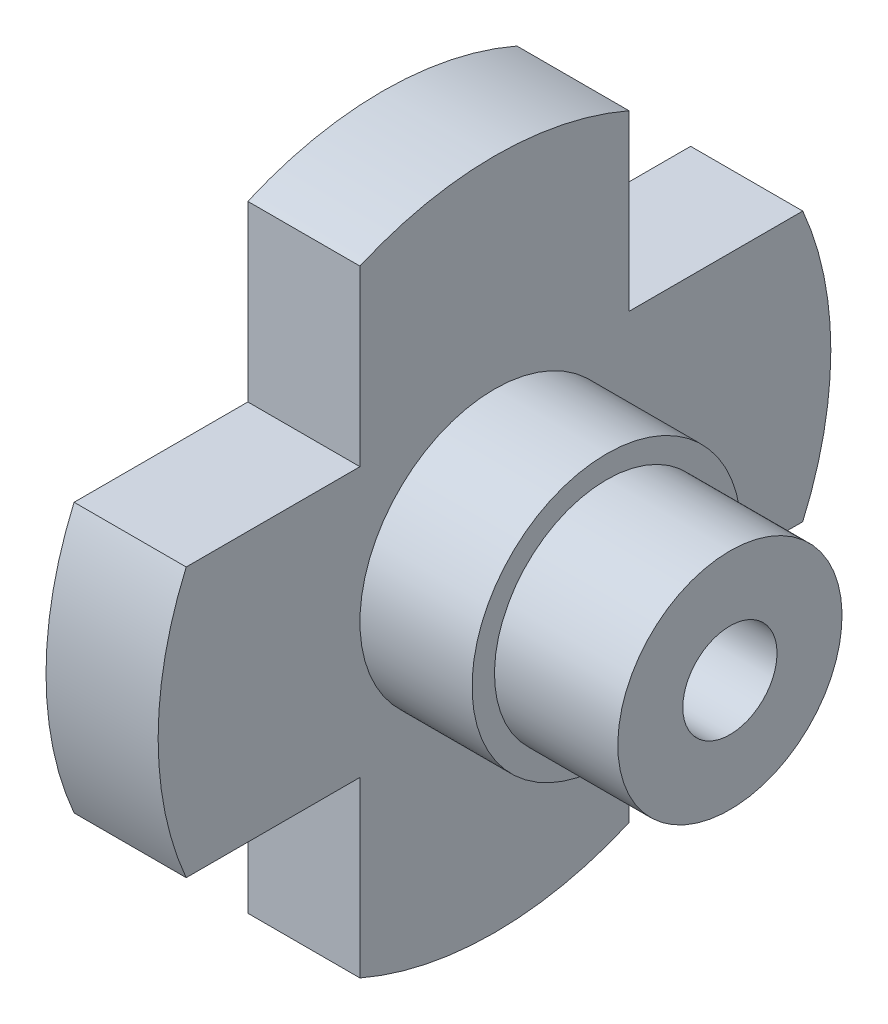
ISO-10303-21;
HEADER;
FILE_DESCRIPTION(('STEP AP214'),'2;1');
FILE_NAME('part.step','',(''),(''),'','','');
FILE_SCHEMA(('AUTOMOTIVE_DESIGN { 1 0 10303 214 1 1 1 1 }'));
ENDSEC;
DATA;
#1=APPLICATION_CONTEXT('core data for automotive mechanical design processes');
#2=APPLICATION_PROTOCOL_DEFINITION('international standard','automotive_design',2000,#1);
#3=PRODUCT_CONTEXT('',#1,'mechanical');
#4=PRODUCT('Part','Part','',(#3));
#5=PRODUCT_RELATED_PRODUCT_CATEGORY('part','',(#4));
#6=PRODUCT_DEFINITION_FORMATION('','',#4);
#7=PRODUCT_DEFINITION_CONTEXT('part definition',#1,'design');
#8=PRODUCT_DEFINITION('design','',#6,#7);
#9=PRODUCT_DEFINITION_SHAPE('','',#8);
#10=(LENGTH_UNIT() NAMED_UNIT(*) SI_UNIT(.MILLI.,.METRE.));
#11=(NAMED_UNIT(*) PLANE_ANGLE_UNIT() SI_UNIT($,.RADIAN.));
#12=(NAMED_UNIT(*) SI_UNIT($,.STERADIAN.) SOLID_ANGLE_UNIT());
#13=UNCERTAINTY_MEASURE_WITH_UNIT(LENGTH_MEASURE(1.E-05),#10,'distance_accuracy_value','');
#14=(GEOMETRIC_REPRESENTATION_CONTEXT(3) GLOBAL_UNCERTAINTY_ASSIGNED_CONTEXT((#13)) GLOBAL_UNIT_ASSIGNED_CONTEXT((#10,
#11,#12)) REPRESENTATION_CONTEXT('',''));
#15=CARTESIAN_POINT('',(0.,0.,0.));
#16=DIRECTION('',(0.,0.,1.));
#17=DIRECTION('',(1.,0.,0.));
#18=AXIS2_PLACEMENT_3D('',#15,#16,#17);
#19=CARTESIAN_POINT('',(-15.5,0.,0.));
#20=DIRECTION('',(-1.,0.,0.));
#21=DIRECTION('',(0.,-1.,0.));
#22=AXIS2_PLACEMENT_3D('',#19,#20,#21);
#23=PLANE('',#22);
#24=CARTESIAN_POINT('',(-15.5,0.,0.));
#25=DIRECTION('',(-1.,0.,0.));
#26=DIRECTION('',(0.,0.,1.));
#27=AXIS2_PLACEMENT_3D('',#24,#25,#26);
#28=CIRCLE('',#27,2.09999999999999);
#29=CARTESIAN_POINT('',(-15.5,0.,2.09999999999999));
#30=VERTEX_POINT('',#29);
#31=EDGE_CURVE('E178',#30,#30,#28,.T.);
#32=ORIENTED_EDGE('',*,*,#31,.F.);
#33=EDGE_LOOP('',(#32));
#34=FACE_BOUND('',#33,.T.);
#35=CARTESIAN_POINT('',(-15.5,0.,0.));
#36=DIRECTION('',(1.,0.,0.));
#37=DIRECTION('',(0.,1.,0.));
#38=AXIS2_PLACEMENT_3D('',#35,#36,#37);
#39=CIRCLE('',#38,15.);
#40=CARTESIAN_POINT('',(-15.5,13.7477270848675,-6.));
#41=VERTEX_POINT('',#40);
#42=CARTESIAN_POINT('',(-15.5,13.7477270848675,6.));
#43=VERTEX_POINT('',#42);
#44=EDGE_CURVE('E137',#41,#43,#39,.T.);
#45=ORIENTED_EDGE('',*,*,#44,.F.);
#46=DIRECTION('',(0.,-1.,0.));
#47=VECTOR('',#46,1.);
#48=CARTESIAN_POINT('',(-15.5,-41.5965024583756,-6.));
#49=LINE('',#48,#47);
#50=CARTESIAN_POINT('',(-15.5,6.,-6.));
#51=VERTEX_POINT('',#50);
#52=EDGE_CURVE('E124',#41,#51,#49,.T.);
#53=ORIENTED_EDGE('',*,*,#52,.T.);
#54=DIRECTION('',(0.,0.,-1.));
#55=VECTOR('',#54,1.);
#56=CARTESIAN_POINT('',(-15.5,6.,0.131629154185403));
#57=LINE('',#56,#55);
#58=CARTESIAN_POINT('',(-15.5,6.,-13.7477270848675));
#59=VERTEX_POINT('',#58);
#60=EDGE_CURVE('E129',#51,#59,#57,.T.);
#61=ORIENTED_EDGE('',*,*,#60,.T.);
#62=CARTESIAN_POINT('',(-15.5,-6.00000000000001,-13.7477270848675));
#63=VERTEX_POINT('',#62);
#64=EDGE_CURVE('E202',#63,#59,#39,.T.);
#65=ORIENTED_EDGE('',*,*,#64,.F.);
#66=DIRECTION('',(0.,0.,-1.));
#67=VECTOR('',#66,1.);
#68=CARTESIAN_POINT('',(-15.5,-6.00000000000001,0.131629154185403));
#69=LINE('',#68,#67);
#70=CARTESIAN_POINT('',(-15.5,-6.00000000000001,-6.));
#71=VERTEX_POINT('',#70);
#72=EDGE_CURVE('E169',#71,#63,#69,.T.);
#73=ORIENTED_EDGE('',*,*,#72,.F.);
#74=DIRECTION('',(0.,-1.,0.));
#75=VECTOR('',#74,1.);
#76=CARTESIAN_POINT('',(-15.5,-41.5965024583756,-6.));
#77=LINE('',#76,#75);
#78=CARTESIAN_POINT('',(-15.5,-13.7477270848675,-6.));
#79=VERTEX_POINT('',#78);
#80=EDGE_CURVE('E166',#71,#79,#77,.T.);
#81=ORIENTED_EDGE('',*,*,#80,.T.);
#82=CARTESIAN_POINT('',(-15.5,-13.7477270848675,6.));
#83=VERTEX_POINT('',#82);
#84=EDGE_CURVE('E200',#83,#79,#39,.T.);
#85=ORIENTED_EDGE('',*,*,#84,.F.);
#86=DIRECTION('',(0.,-1.,0.));
#87=VECTOR('',#86,1.);
#88=CARTESIAN_POINT('',(-15.5,-41.5965024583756,6.));
#89=LINE('',#88,#87);
#90=CARTESIAN_POINT('',(-15.5,-6.00000000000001,6.));
#91=VERTEX_POINT('',#90);
#92=EDGE_CURVE('E157',#91,#83,#89,.T.);
#93=ORIENTED_EDGE('',*,*,#92,.F.);
#94=DIRECTION('',(0.,0.,-1.));
#95=VECTOR('',#94,1.);
#96=CARTESIAN_POINT('',(-15.5,-6.00000000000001,0.131629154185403));
#97=LINE('',#96,#95);
#98=CARTESIAN_POINT('',(-15.5,-6.00000000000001,13.7477270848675));
#99=VERTEX_POINT('',#98);
#100=EDGE_CURVE('E154',#99,#91,#97,.T.);
#101=ORIENTED_EDGE('',*,*,#100,.F.);
#102=CARTESIAN_POINT('',(-15.5,6.,13.7477270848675));
#103=VERTEX_POINT('',#102);
#104=EDGE_CURVE('E241',#103,#99,#39,.T.);
#105=ORIENTED_EDGE('',*,*,#104,.F.);
#106=DIRECTION('',(0.,0.,-1.));
#107=VECTOR('',#106,1.);
#108=CARTESIAN_POINT('',(-15.5,6.,0.131629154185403));
#109=LINE('',#108,#107);
#110=CARTESIAN_POINT('',(-15.5,6.,6.));
#111=VERTEX_POINT('',#110);
#112=EDGE_CURVE('E144',#103,#111,#109,.T.);
#113=ORIENTED_EDGE('',*,*,#112,.T.);
#114=DIRECTION('',(0.,-1.,0.));
#115=VECTOR('',#114,1.);
#116=CARTESIAN_POINT('',(-15.5,-41.5965024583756,6.));
#117=LINE('',#116,#115);
#118=EDGE_CURVE('E142',#43,#111,#117,.T.);
#119=ORIENTED_EDGE('',*,*,#118,.F.);
#120=EDGE_LOOP('',(#45,#53,#61,#65,#73,#81,#85,#93,#101,#105,#113,#119));
#121=FACE_BOUND('',#120,.T.);
#122=ADVANCED_FACE('F31',(#34,#121),#23,.T.);
#123=CARTESIAN_POINT('',(-10.5,15.,0.));
#124=DIRECTION('',(1.,0.,0.));
#125=DIRECTION('',(0.,1.,0.));
#126=AXIS2_PLACEMENT_3D('',#123,#124,#125);
#127=PLANE('',#126);
#128=CARTESIAN_POINT('',(-10.5,0.,0.));
#129=DIRECTION('',(1.,0.,0.));
#130=DIRECTION('',(0.,1.,0.));
#131=AXIS2_PLACEMENT_3D('',#128,#129,#130);
#132=CIRCLE('',#131,6.);
#133=CARTESIAN_POINT('',(-10.5,5.99999999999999,0.));
#134=VERTEX_POINT('',#133);
#135=EDGE_CURVE('E193',#134,#134,#132,.T.);
#136=ORIENTED_EDGE('',*,*,#135,.F.);
#137=EDGE_LOOP('',(#136));
#138=FACE_BOUND('',#137,.T.);
#139=DIRECTION('',(0.,0.,1.));
#140=VECTOR('',#139,1.);
#141=CARTESIAN_POINT('',(-10.5,6.,0.));
#142=LINE('',#141,#140);
#143=CARTESIAN_POINT('',(-10.5,6.,-13.7477270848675));
#144=VERTEX_POINT('',#143);
#145=CARTESIAN_POINT('',(-10.5,6.,-6.));
#146=VERTEX_POINT('',#145);
#147=EDGE_CURVE('E46',#144,#146,#142,.T.);
#148=ORIENTED_EDGE('',*,*,#147,.T.);
#149=DIRECTION('',(0.,1.,0.));
#150=VECTOR('',#149,1.);
#151=CARTESIAN_POINT('',(-10.5,15.,-6.));
#152=LINE('',#151,#150);
#153=CARTESIAN_POINT('',(-10.5,13.7477270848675,-6.));
#154=VERTEX_POINT('',#153);
#155=EDGE_CURVE('E126',#146,#154,#152,.T.);
#156=ORIENTED_EDGE('',*,*,#155,.T.);
#157=CARTESIAN_POINT('',(-10.5,0.,0.));
#158=DIRECTION('',(1.,0.,0.));
#159=DIRECTION('',(0.,1.,0.));
#160=AXIS2_PLACEMENT_3D('',#157,#158,#159);
#161=CIRCLE('',#160,15.);
#162=CARTESIAN_POINT('',(-10.5,13.7477270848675,6.));
#163=VERTEX_POINT('',#162);
#164=EDGE_CURVE('E201',#154,#163,#161,.T.);
#165=ORIENTED_EDGE('',*,*,#164,.T.);
#166=DIRECTION('',(0.,1.,0.));
#167=VECTOR('',#166,1.);
#168=CARTESIAN_POINT('',(-10.5,15.,6.));
#169=LINE('',#168,#167);
#170=CARTESIAN_POINT('',(-10.5,6.,6.));
#171=VERTEX_POINT('',#170);
#172=EDGE_CURVE('E216',#171,#163,#169,.T.);
#173=ORIENTED_EDGE('',*,*,#172,.F.);
#174=DIRECTION('',(0.,0.,1.));
#175=VECTOR('',#174,1.);
#176=CARTESIAN_POINT('',(-10.5,6.,0.));
#177=LINE('',#176,#175);
#178=CARTESIAN_POINT('',(-10.5,6.,13.7477270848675));
#179=VERTEX_POINT('',#178);
#180=EDGE_CURVE('E218',#171,#179,#177,.T.);
#181=ORIENTED_EDGE('',*,*,#180,.T.);
#182=CARTESIAN_POINT('',(-10.5,-6.00000000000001,13.7477270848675));
#183=VERTEX_POINT('',#182);
#184=EDGE_CURVE('E256',#179,#183,#161,.T.);
#185=ORIENTED_EDGE('',*,*,#184,.T.);
#186=DIRECTION('',(0.,0.,1.));
#187=VECTOR('',#186,1.);
#188=CARTESIAN_POINT('',(-10.5,-6.00000000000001,0.));
#189=LINE('',#188,#187);
#190=CARTESIAN_POINT('',(-10.5,-6.00000000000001,6.));
#191=VERTEX_POINT('',#190);
#192=EDGE_CURVE('E210',#191,#183,#189,.T.);
#193=ORIENTED_EDGE('',*,*,#192,.F.);
#194=DIRECTION('',(0.,1.,0.));
#195=VECTOR('',#194,1.);
#196=CARTESIAN_POINT('',(-10.5,15.,6.));
#197=LINE('',#196,#195);
#198=CARTESIAN_POINT('',(-10.5,-13.7477270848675,6.));
#199=VERTEX_POINT('',#198);
#200=EDGE_CURVE('E213',#199,#191,#197,.T.);
#201=ORIENTED_EDGE('',*,*,#200,.F.);
#202=CARTESIAN_POINT('',(-10.5,-13.7477270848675,-6.));
#203=VERTEX_POINT('',#202);
#204=EDGE_CURVE('E196',#199,#203,#161,.T.);
#205=ORIENTED_EDGE('',*,*,#204,.T.);
#206=DIRECTION('',(0.,1.,0.));
#207=VECTOR('',#206,1.);
#208=CARTESIAN_POINT('',(-10.5,15.,-6.));
#209=LINE('',#208,#207);
#210=CARTESIAN_POINT('',(-10.5,-6.00000000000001,-6.));
#211=VERTEX_POINT('',#210);
#212=EDGE_CURVE('E204',#203,#211,#209,.T.);
#213=ORIENTED_EDGE('',*,*,#212,.T.);
#214=DIRECTION('',(0.,0.,1.));
#215=VECTOR('',#214,1.);
#216=CARTESIAN_POINT('',(-10.5,-6.00000000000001,0.));
#217=LINE('',#216,#215);
#218=CARTESIAN_POINT('',(-10.5,-6.00000000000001,-13.7477270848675));
#219=VERTEX_POINT('',#218);
#220=EDGE_CURVE('E207',#219,#211,#217,.T.);
#221=ORIENTED_EDGE('',*,*,#220,.F.);
#222=EDGE_CURVE('E197',#219,#144,#161,.T.);
#223=ORIENTED_EDGE('',*,*,#222,.T.);
#224=EDGE_LOOP('',(#148,#156,#165,#173,#181,#185,#193,#201,#205,#213,#221,#223));
#225=FACE_BOUND('',#224,.T.);
#226=ADVANCED_FACE('F226',(#138,#225),#127,.T.);
#227=CARTESIAN_POINT('',(0.,0.,0.));
#228=DIRECTION('',(1.,0.,0.));
#229=DIRECTION('',(0.,1.,0.));
#230=AXIS2_PLACEMENT_3D('',#227,#228,#229);
#231=CYLINDRICAL_SURFACE('',#230,15.);
#232=ORIENTED_EDGE('',*,*,#164,.F.);
#233=DIRECTION('',(1.,0.,0.));
#234=VECTOR('',#233,1.);
#235=CARTESIAN_POINT('',(0.,13.7477270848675,-6.));
#236=LINE('',#235,#234);
#237=EDGE_CURVE('E11',#154,#41,#236,.F.);
#238=ORIENTED_EDGE('',*,*,#237,.T.);
#239=ORIENTED_EDGE('',*,*,#44,.T.);
#240=DIRECTION('',(1.,0.,0.));
#241=VECTOR('',#240,1.);
#242=CARTESIAN_POINT('',(0.,13.7477270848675,6.));
#243=LINE('',#242,#241);
#244=EDGE_CURVE('E148',#163,#43,#243,.F.);
#245=ORIENTED_EDGE('',*,*,#244,.F.);
#246=EDGE_LOOP('',(#232,#238,#239,#245));
#247=FACE_BOUND('',#246,.T.);
#248=ADVANCED_FACE('F248',(#247),#231,.T.);
#249=ORIENTED_EDGE('',*,*,#64,.T.);
#250=DIRECTION('',(1.,0.,0.));
#251=VECTOR('',#250,1.);
#252=CARTESIAN_POINT('',(0.,6.,-13.7477270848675));
#253=LINE('',#252,#251);
#254=EDGE_CURVE('E39',#59,#144,#253,.T.);
#255=ORIENTED_EDGE('',*,*,#254,.T.);
#256=ORIENTED_EDGE('',*,*,#222,.F.);
#257=DIRECTION('',(1.,0.,0.));
#258=VECTOR('',#257,1.);
#259=CARTESIAN_POINT('',(0.,-6.,-13.7477270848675));
#260=LINE('',#259,#258);
#261=EDGE_CURVE('E176',#63,#219,#260,.T.);
#262=ORIENTED_EDGE('',*,*,#261,.F.);
#263=EDGE_LOOP('',(#249,#255,#256,#262));
#264=FACE_BOUND('',#263,.T.);
#265=ADVANCED_FACE('F222',(#264),#231,.T.);
#266=ORIENTED_EDGE('',*,*,#184,.F.);
#267=DIRECTION('',(1.,0.,0.));
#268=VECTOR('',#267,1.);
#269=CARTESIAN_POINT('',(0.,6.,13.7477270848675));
#270=LINE('',#269,#268);
#271=EDGE_CURVE('E151',#179,#103,#270,.F.);
#272=ORIENTED_EDGE('',*,*,#271,.T.);
#273=ORIENTED_EDGE('',*,*,#104,.T.);
#274=DIRECTION('',(1.,0.,0.));
#275=VECTOR('',#274,1.);
#276=CARTESIAN_POINT('',(0.,-6.,13.7477270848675));
#277=LINE('',#276,#275);
#278=EDGE_CURVE('E161',#183,#99,#277,.F.);
#279=ORIENTED_EDGE('',*,*,#278,.F.);
#280=EDGE_LOOP('',(#266,#272,#273,#279));
#281=FACE_BOUND('',#280,.T.);
#282=ADVANCED_FACE('F255',(#281),#231,.T.);
#283=DIRECTION('',(1.,0.,0.));
#284=VECTOR('',#283,1.);
#285=CARTESIAN_POINT('',(0.,-13.7477270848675,6.));
#286=LINE('',#285,#284);
#287=EDGE_CURVE('E164',#83,#199,#286,.T.);
#288=ORIENTED_EDGE('',*,*,#287,.F.);
#289=ORIENTED_EDGE('',*,*,#84,.T.);
#290=DIRECTION('',(1.,0.,0.));
#291=VECTOR('',#290,1.);
#292=CARTESIAN_POINT('',(0.,-13.7477270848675,-6.));
#293=LINE('',#292,#291);
#294=EDGE_CURVE('E173',#79,#203,#293,.T.);
#295=ORIENTED_EDGE('',*,*,#294,.T.);
#296=ORIENTED_EDGE('',*,*,#204,.F.);
#297=EDGE_LOOP('',(#288,#289,#295,#296));
#298=FACE_BOUND('',#297,.T.);
#299=ADVANCED_FACE('F240',(#298),#231,.T.);
#300=CARTESIAN_POINT('',(0.,5.,0.));
#301=DIRECTION('',(1.,0.,0.));
#302=DIRECTION('',(0.,1.,0.));
#303=AXIS2_PLACEMENT_3D('',#300,#301,#302);
#304=PLANE('',#303);
#305=CARTESIAN_POINT('',(0.,0.,0.));
#306=DIRECTION('',(-1.,0.,0.));
#307=DIRECTION('',(0.,0.,1.));
#308=AXIS2_PLACEMENT_3D('',#305,#306,#307);
#309=CIRCLE('',#308,2.1);
#310=CARTESIAN_POINT('',(0.,0.,2.1));
#311=VERTEX_POINT('',#310);
#312=EDGE_CURVE('E181',#311,#311,#309,.T.);
#313=ORIENTED_EDGE('',*,*,#312,.T.);
#314=EDGE_LOOP('',(#313));
#315=FACE_BOUND('',#314,.T.);
#316=CARTESIAN_POINT('',(0.,0.,0.));
#317=DIRECTION('',(1.,0.,0.));
#318=DIRECTION('',(0.,1.,0.));
#319=AXIS2_PLACEMENT_3D('',#316,#317,#318);
#320=CIRCLE('',#319,5.);
#321=CARTESIAN_POINT('',(0.,5.,0.));
#322=VERTEX_POINT('',#321);
#323=EDGE_CURVE('E184',#322,#322,#320,.T.);
#324=ORIENTED_EDGE('',*,*,#323,.T.);
#325=EDGE_LOOP('',(#324));
#326=FACE_BOUND('',#325,.T.);
#327=ADVANCED_FACE('F33',(#315,#326),#304,.T.);
#328=CARTESIAN_POINT('',(0.,0.,0.));
#329=DIRECTION('',(1.,0.,0.));
#330=DIRECTION('',(0.,1.,0.));
#331=AXIS2_PLACEMENT_3D('',#328,#329,#330);
#332=CYLINDRICAL_SURFACE('',#331,6.);
#333=ORIENTED_EDGE('',*,*,#135,.T.);
#334=EDGE_LOOP('',(#333));
#335=FACE_BOUND('',#334,.T.);
#336=CARTESIAN_POINT('',(-5.5,0.,0.));
#337=DIRECTION('',(1.,0.,0.));
#338=DIRECTION('',(0.,1.,0.));
#339=AXIS2_PLACEMENT_3D('',#336,#337,#338);
#340=CIRCLE('',#339,6.);
#341=CARTESIAN_POINT('',(-5.5,5.99999999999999,0.));
#342=VERTEX_POINT('',#341);
#343=EDGE_CURVE('E190',#342,#342,#340,.T.);
#344=ORIENTED_EDGE('',*,*,#343,.F.);
#345=EDGE_LOOP('',(#344));
#346=FACE_BOUND('',#345,.T.);
#347=ADVANCED_FACE('F283',(#335,#346),#332,.T.);
#348=CARTESIAN_POINT('',(-5.5,5.99999999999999,0.));
#349=DIRECTION('',(1.,0.,0.));
#350=DIRECTION('',(0.,1.,0.));
#351=AXIS2_PLACEMENT_3D('',#348,#349,#350);
#352=PLANE('',#351);
#353=ORIENTED_EDGE('',*,*,#343,.T.);
#354=EDGE_LOOP('',(#353));
#355=FACE_BOUND('',#354,.T.);
#356=CARTESIAN_POINT('',(-5.5,0.,0.));
#357=DIRECTION('',(1.,0.,0.));
#358=DIRECTION('',(0.,1.,0.));
#359=AXIS2_PLACEMENT_3D('',#356,#357,#358);
#360=CIRCLE('',#359,5.);
#361=CARTESIAN_POINT('',(-5.5,5.,0.));
#362=VERTEX_POINT('',#361);
#363=EDGE_CURVE('E187',#362,#362,#360,.T.);
#364=ORIENTED_EDGE('',*,*,#363,.F.);
#365=EDGE_LOOP('',(#364));
#366=FACE_BOUND('',#365,.T.);
#367=ADVANCED_FACE('F286',(#355,#366),#352,.T.);
#368=CARTESIAN_POINT('',(0.,0.,0.));
#369=DIRECTION('',(1.,0.,0.));
#370=DIRECTION('',(0.,1.,0.));
#371=AXIS2_PLACEMENT_3D('',#368,#369,#370);
#372=CYLINDRICAL_SURFACE('',#371,5.);
#373=ORIENTED_EDGE('',*,*,#363,.T.);
#374=EDGE_LOOP('',(#373));
#375=FACE_BOUND('',#374,.T.);
#376=ORIENTED_EDGE('',*,*,#323,.F.);
#377=EDGE_LOOP('',(#376));
#378=FACE_BOUND('',#377,.T.);
#379=ADVANCED_FACE('F290',(#375,#378),#372,.T.);
#380=CARTESIAN_POINT('',(-15.5,0.,0.));
#381=DIRECTION('',(-1.,0.,0.));
#382=DIRECTION('',(0.,0.,1.));
#383=AXIS2_PLACEMENT_3D('',#380,#381,#382);
#384=CYLINDRICAL_SURFACE('',#383,2.09999999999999);
#385=ORIENTED_EDGE('',*,*,#312,.F.);
#386=EDGE_LOOP('',(#385));
#387=FACE_BOUND('',#386,.T.);
#388=ORIENTED_EDGE('',*,*,#31,.T.);
#389=EDGE_LOOP('',(#388));
#390=FACE_BOUND('',#389,.T.);
#391=ADVANCED_FACE('F294',(#387,#390),#384,.F.);
#392=CARTESIAN_POINT('',(-5.5,-6.,0.131629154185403));
#393=DIRECTION('',(0.,1.,0.));
#394=DIRECTION('',(-1.,0.,0.));
#395=AXIS2_PLACEMENT_3D('',#392,#393,#394);
#396=PLANE('',#395);
#397=ORIENTED_EDGE('',*,*,#261,.T.);
#398=ORIENTED_EDGE('',*,*,#220,.T.);
#399=DIRECTION('',(-1.,0.,0.));
#400=VECTOR('',#399,1.);
#401=CARTESIAN_POINT('',(-5.5,-6.,-6.));
#402=LINE('',#401,#400);
#403=EDGE_CURVE('E171',#211,#71,#402,.T.);
#404=ORIENTED_EDGE('',*,*,#403,.T.);
#405=ORIENTED_EDGE('',*,*,#72,.T.);
#406=EDGE_LOOP('',(#397,#398,#404,#405));
#407=FACE_BOUND('',#406,.T.);
#408=ADVANCED_FACE('F229',(#407),#396,.F.);
#409=CARTESIAN_POINT('',(-5.49999999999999,-41.5965024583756,-6.));
#410=DIRECTION('',(0.,0.,-1.));
#411=DIRECTION('',(-1.,0.,0.));
#412=AXIS2_PLACEMENT_3D('',#409,#410,#411);
#413=PLANE('',#412);
#414=ORIENTED_EDGE('',*,*,#80,.F.);
#415=ORIENTED_EDGE('',*,*,#403,.F.);
#416=ORIENTED_EDGE('',*,*,#212,.F.);
#417=ORIENTED_EDGE('',*,*,#294,.F.);
#418=EDGE_LOOP('',(#414,#415,#416,#417));
#419=FACE_BOUND('',#418,.T.);
#420=ADVANCED_FACE('F236',(#419),#413,.T.);
#421=CARTESIAN_POINT('',(-5.49999999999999,-41.5965024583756,6.));
#422=DIRECTION('',(0.,0.,-1.));
#423=DIRECTION('',(-1.,0.,0.));
#424=AXIS2_PLACEMENT_3D('',#421,#422,#423);
#425=PLANE('',#424);
#426=ORIENTED_EDGE('',*,*,#287,.T.);
#427=ORIENTED_EDGE('',*,*,#200,.T.);
#428=DIRECTION('',(-1.,0.,0.));
#429=VECTOR('',#428,1.);
#430=CARTESIAN_POINT('',(-5.5,-6.,6.));
#431=LINE('',#430,#429);
#432=EDGE_CURVE('E159',#191,#91,#431,.T.);
#433=ORIENTED_EDGE('',*,*,#432,.T.);
#434=ORIENTED_EDGE('',*,*,#92,.T.);
#435=EDGE_LOOP('',(#426,#427,#433,#434));
#436=FACE_BOUND('',#435,.T.);
#437=ADVANCED_FACE('F260',(#436),#425,.F.);
#438=CARTESIAN_POINT('',(-5.5,-6.,0.131629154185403));
#439=DIRECTION('',(0.,1.,0.));
#440=DIRECTION('',(-1.,0.,0.));
#441=AXIS2_PLACEMENT_3D('',#438,#439,#440);
#442=PLANE('',#441);
#443=ORIENTED_EDGE('',*,*,#278,.T.);
#444=ORIENTED_EDGE('',*,*,#100,.T.);
#445=ORIENTED_EDGE('',*,*,#432,.F.);
#446=ORIENTED_EDGE('',*,*,#192,.T.);
#447=EDGE_LOOP('',(#443,#444,#445,#446));
#448=FACE_BOUND('',#447,.T.);
#449=ADVANCED_FACE('F262',(#448),#442,.F.);
#450=CARTESIAN_POINT('',(-5.5,6.,0.131629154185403));
#451=DIRECTION('',(0.,1.,0.));
#452=DIRECTION('',(-1.,0.,0.));
#453=AXIS2_PLACEMENT_3D('',#450,#451,#452);
#454=PLANE('',#453);
#455=ORIENTED_EDGE('',*,*,#180,.F.);
#456=DIRECTION('',(-1.,0.,0.));
#457=VECTOR('',#456,1.);
#458=CARTESIAN_POINT('',(-5.5,6.,6.));
#459=LINE('',#458,#457);
#460=EDGE_CURVE('E54',#171,#111,#459,.T.);
#461=ORIENTED_EDGE('',*,*,#460,.T.);
#462=ORIENTED_EDGE('',*,*,#112,.F.);
#463=ORIENTED_EDGE('',*,*,#271,.F.);
#464=EDGE_LOOP('',(#455,#461,#462,#463));
#465=FACE_BOUND('',#464,.T.);
#466=ADVANCED_FACE('F253',(#465),#454,.T.);
#467=CARTESIAN_POINT('',(-5.49999999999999,-41.5965024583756,6.));
#468=DIRECTION('',(0.,0.,-1.));
#469=DIRECTION('',(-1.,0.,0.));
#470=AXIS2_PLACEMENT_3D('',#467,#468,#469);
#471=PLANE('',#470);
#472=ORIENTED_EDGE('',*,*,#244,.T.);
#473=ORIENTED_EDGE('',*,*,#118,.T.);
#474=ORIENTED_EDGE('',*,*,#460,.F.);
#475=ORIENTED_EDGE('',*,*,#172,.T.);
#476=EDGE_LOOP('',(#472,#473,#474,#475));
#477=FACE_BOUND('',#476,.T.);
#478=ADVANCED_FACE('F249',(#477),#471,.F.);
#479=CARTESIAN_POINT('',(-5.49999999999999,-41.5965024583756,-6.));
#480=DIRECTION('',(0.,0.,-1.));
#481=DIRECTION('',(-1.,0.,0.));
#482=AXIS2_PLACEMENT_3D('',#479,#480,#481);
#483=PLANE('',#482);
#484=DIRECTION('',(-1.,0.,0.));
#485=VECTOR('',#484,1.);
#486=CARTESIAN_POINT('',(-5.5,6.,-6.));
#487=LINE('',#486,#485);
#488=EDGE_CURVE('E120',#146,#51,#487,.T.);
#489=ORIENTED_EDGE('',*,*,#488,.T.);
#490=ORIENTED_EDGE('',*,*,#52,.F.);
#491=ORIENTED_EDGE('',*,*,#237,.F.);
#492=ORIENTED_EDGE('',*,*,#155,.F.);
#493=EDGE_LOOP('',(#489,#490,#491,#492));
#494=FACE_BOUND('',#493,.T.);
#495=ADVANCED_FACE('F122',(#494),#483,.T.);
#496=CARTESIAN_POINT('',(-5.5,6.,0.131629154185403));
#497=DIRECTION('',(0.,1.,0.));
#498=DIRECTION('',(-1.,0.,0.));
#499=AXIS2_PLACEMENT_3D('',#496,#497,#498);
#500=PLANE('',#499);
#501=ORIENTED_EDGE('',*,*,#254,.F.);
#502=ORIENTED_EDGE('',*,*,#60,.F.);
#503=ORIENTED_EDGE('',*,*,#488,.F.);
#504=ORIENTED_EDGE('',*,*,#147,.F.);
#505=EDGE_LOOP('',(#501,#502,#503,#504));
#506=FACE_BOUND('',#505,.T.);
#507=ADVANCED_FACE('F130',(#506),#500,.T.);
#508=CLOSED_SHELL('',(#122,#226,#248,#265,#282,#299,#327,#347,#367,#379,#391,#408,#420,#437,
#449,#466,#478,#495,#507));
#509=MANIFOLD_SOLID_BREP('B2',#508);
#510=ADVANCED_BREP_SHAPE_REPRESENTATION('',(#18,#509),#14);
#511=SHAPE_DEFINITION_REPRESENTATION(#9,#510);
ENDSEC;
END-ISO-10303-21;
